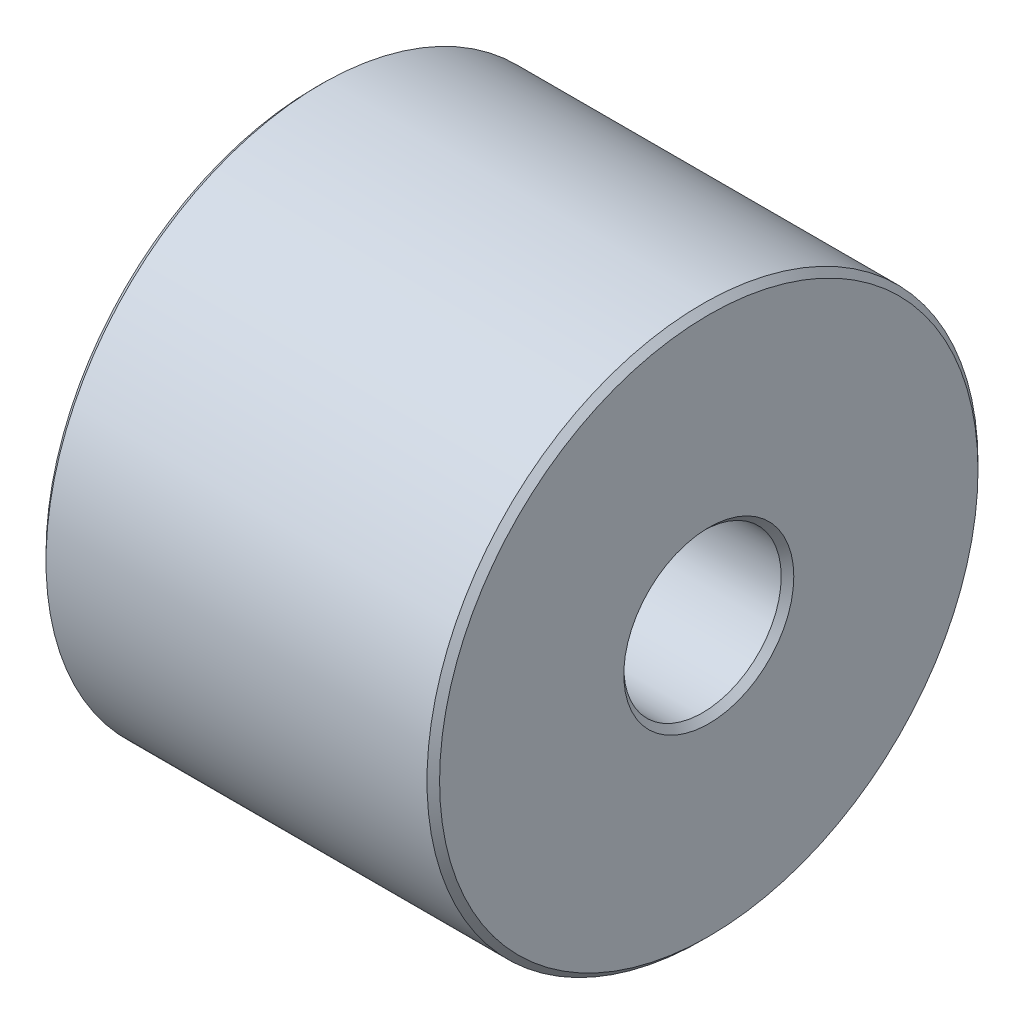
ISO-10303-21;
HEADER;
FILE_DESCRIPTION(('STEP AP214'),'2;1');
FILE_NAME('part.step','',(''),(''),'','','');
FILE_SCHEMA(('AUTOMOTIVE_DESIGN { 1 0 10303 214 1 1 1 1 }'));
ENDSEC;
DATA;
#1=APPLICATION_CONTEXT('core data for automotive mechanical design processes');
#2=APPLICATION_PROTOCOL_DEFINITION('international standard','automotive_design',2000,#1);
#3=PRODUCT_CONTEXT('',#1,'mechanical');
#4=PRODUCT('Part','Part','',(#3));
#5=PRODUCT_RELATED_PRODUCT_CATEGORY('part','',(#4));
#6=PRODUCT_DEFINITION_FORMATION('','',#4);
#7=PRODUCT_DEFINITION_CONTEXT('part definition',#1,'design');
#8=PRODUCT_DEFINITION('design','',#6,#7);
#9=PRODUCT_DEFINITION_SHAPE('','',#8);
#10=(LENGTH_UNIT() NAMED_UNIT(*) SI_UNIT(.MILLI.,.METRE.));
#11=(NAMED_UNIT(*) PLANE_ANGLE_UNIT() SI_UNIT($,.RADIAN.));
#12=(NAMED_UNIT(*) SI_UNIT($,.STERADIAN.) SOLID_ANGLE_UNIT());
#13=UNCERTAINTY_MEASURE_WITH_UNIT(LENGTH_MEASURE(1.E-05),#10,'distance_accuracy_value','');
#14=(GEOMETRIC_REPRESENTATION_CONTEXT(3) GLOBAL_UNCERTAINTY_ASSIGNED_CONTEXT((#13)) GLOBAL_UNIT_ASSIGNED_CONTEXT((#10,
#11,#12)) REPRESENTATION_CONTEXT('',''));
#15=CARTESIAN_POINT('',(0.,0.,0.));
#16=DIRECTION('',(0.,0.,1.));
#17=DIRECTION('',(1.,0.,0.));
#18=AXIS2_PLACEMENT_3D('',#15,#16,#17);
#19=CARTESIAN_POINT('',(15.875,0.,0.));
#20=DIRECTION('',(1.,0.,0.));
#21=DIRECTION('',(0.,0.,-1.));
#22=AXIS2_PLACEMENT_3D('',#19,#20,#21);
#23=PLANE('',#22);
#24=CARTESIAN_POINT('',(15.875,0.,0.));
#25=DIRECTION('',(1.,0.,0.));
#26=DIRECTION('',(0.,0.,-1.));
#27=AXIS2_PLACEMENT_3D('',#24,#25,#26);
#28=CIRCLE('',#27,3.42900000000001);
#29=CARTESIAN_POINT('',(15.875,0.,-3.42900000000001));
#30=VERTEX_POINT('',#29);
#31=EDGE_CURVE('E9',#30,#30,#28,.F.);
#32=ORIENTED_EDGE('',*,*,#31,.T.);
#33=EDGE_LOOP('',(#32));
#34=FACE_BOUND('',#33,.T.);
#35=CARTESIAN_POINT('',(15.875,0.,0.));
#36=DIRECTION('',(1.,0.,0.));
#37=DIRECTION('',(0.,0.,-1.));
#38=AXIS2_PLACEMENT_3D('',#35,#36,#37);
#39=CIRCLE('',#38,10.8585);
#40=CARTESIAN_POINT('',(15.875,0.,-10.8585));
#41=VERTEX_POINT('',#40);
#42=EDGE_CURVE('E21',#41,#41,#39,.T.);
#43=ORIENTED_EDGE('',*,*,#42,.T.);
#44=EDGE_LOOP('',(#43));
#45=FACE_BOUND('',#44,.T.);
#46=ADVANCED_FACE('F14',(#34,#45),#23,.T.);
#47=CARTESIAN_POINT('',(0.,0.,0.));
#48=DIRECTION('',(1.,0.,0.));
#49=DIRECTION('',(0.,0.,-1.));
#50=AXIS2_PLACEMENT_3D('',#47,#48,#49);
#51=PLANE('',#50);
#52=CARTESIAN_POINT('',(0.,0.,0.));
#53=DIRECTION('',(1.,0.,0.));
#54=DIRECTION('',(0.,0.,-1.));
#55=AXIS2_PLACEMENT_3D('',#52,#53,#54);
#56=CIRCLE('',#55,3.429);
#57=CARTESIAN_POINT('',(0.,0.,-3.429));
#58=VERTEX_POINT('',#57);
#59=EDGE_CURVE('E40',#58,#58,#56,.T.);
#60=ORIENTED_EDGE('',*,*,#59,.T.);
#61=EDGE_LOOP('',(#60));
#62=FACE_BOUND('',#61,.T.);
#63=CARTESIAN_POINT('',(0.,0.,0.));
#64=DIRECTION('',(1.,0.,0.));
#65=DIRECTION('',(0.,0.,-1.));
#66=AXIS2_PLACEMENT_3D('',#63,#64,#65);
#67=CIRCLE('',#66,10.8585);
#68=CARTESIAN_POINT('',(0.,0.,-10.8585));
#69=VERTEX_POINT('',#68);
#70=EDGE_CURVE('E43',#69,#69,#67,.F.);
#71=ORIENTED_EDGE('',*,*,#70,.T.);
#72=EDGE_LOOP('',(#71));
#73=FACE_BOUND('',#72,.T.);
#74=ADVANCED_FACE('F47',(#62,#73),#51,.F.);
#75=CARTESIAN_POINT('',(15.875,0.,0.));
#76=DIRECTION('',(-1.,0.,0.));
#77=DIRECTION('',(0.,0.,1.));
#78=AXIS2_PLACEMENT_3D('',#75,#76,#77);
#79=CYLINDRICAL_SURFACE('',#78,11.1125);
#80=CARTESIAN_POINT('',(0.254000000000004,0.,0.));
#81=DIRECTION('',(1.,0.,0.));
#82=DIRECTION('',(0.,0.,-1.));
#83=AXIS2_PLACEMENT_3D('',#80,#81,#82);
#84=CIRCLE('',#83,11.1125);
#85=CARTESIAN_POINT('',(0.254000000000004,0.,-11.1125));
#86=VERTEX_POINT('',#85);
#87=EDGE_CURVE('E25',#86,#86,#84,.T.);
#88=ORIENTED_EDGE('',*,*,#87,.T.);
#89=EDGE_LOOP('',(#88));
#90=FACE_BOUND('',#89,.T.);
#91=CARTESIAN_POINT('',(15.621,0.,0.));
#92=DIRECTION('',(1.,0.,0.));
#93=DIRECTION('',(0.,0.,-1.));
#94=AXIS2_PLACEMENT_3D('',#91,#92,#93);
#95=CIRCLE('',#94,11.1125);
#96=CARTESIAN_POINT('',(15.621,0.,-11.1125));
#97=VERTEX_POINT('',#96);
#98=EDGE_CURVE('E29',#97,#97,#95,.F.);
#99=ORIENTED_EDGE('',*,*,#98,.T.);
#100=EDGE_LOOP('',(#99));
#101=FACE_BOUND('',#100,.T.);
#102=ADVANCED_FACE('F57',(#90,#101),#79,.T.);
#103=CARTESIAN_POINT('',(15.875,0.,0.));
#104=DIRECTION('',(-1.,0.,0.));
#105=DIRECTION('',(0.,0.,1.));
#106=AXIS2_PLACEMENT_3D('',#103,#104,#105);
#107=CYLINDRICAL_SURFACE('',#106,3.175);
#108=CARTESIAN_POINT('',(0.254000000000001,0.,0.));
#109=DIRECTION('',(1.,0.,0.));
#110=DIRECTION('',(0.,0.,-1.));
#111=AXIS2_PLACEMENT_3D('',#108,#109,#110);
#112=CIRCLE('',#111,3.175);
#113=CARTESIAN_POINT('',(0.254000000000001,0.,-3.175));
#114=VERTEX_POINT('',#113);
#115=EDGE_CURVE('E34',#114,#114,#112,.F.);
#116=ORIENTED_EDGE('',*,*,#115,.T.);
#117=EDGE_LOOP('',(#116));
#118=FACE_BOUND('',#117,.T.);
#119=CARTESIAN_POINT('',(15.621,0.,0.));
#120=DIRECTION('',(1.,0.,0.));
#121=DIRECTION('',(0.,0.,-1.));
#122=AXIS2_PLACEMENT_3D('',#119,#120,#121);
#123=CIRCLE('',#122,3.175);
#124=CARTESIAN_POINT('',(15.621,0.,-3.175));
#125=VERTEX_POINT('',#124);
#126=EDGE_CURVE('E37',#125,#125,#123,.T.);
#127=ORIENTED_EDGE('',*,*,#126,.T.);
#128=EDGE_LOOP('',(#127));
#129=FACE_BOUND('',#128,.T.);
#130=ADVANCED_FACE('F60',(#118,#129),#107,.F.);
#131=CARTESIAN_POINT('',(0.,0.,0.));
#132=DIRECTION('',(-1.,0.,0.));
#133=DIRECTION('',(0.,0.,1.));
#134=AXIS2_PLACEMENT_3D('',#131,#132,#133);
#135=CONICAL_SURFACE('',#134,3.429,0.785398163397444);
#136=ORIENTED_EDGE('',*,*,#115,.F.);
#137=EDGE_LOOP('',(#136));
#138=FACE_BOUND('',#137,.T.);
#139=ORIENTED_EDGE('',*,*,#59,.F.);
#140=EDGE_LOOP('',(#139));
#141=FACE_BOUND('',#140,.T.);
#142=ADVANCED_FACE('F53',(#138,#141),#135,.F.);
#143=CARTESIAN_POINT('',(0.254000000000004,0.,0.));
#144=DIRECTION('',(1.,0.,0.));
#145=DIRECTION('',(0.,0.,-1.));
#146=AXIS2_PLACEMENT_3D('',#143,#144,#145);
#147=CONICAL_SURFACE('',#146,11.1125,0.785398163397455);
#148=ORIENTED_EDGE('',*,*,#70,.F.);
#149=EDGE_LOOP('',(#148));
#150=FACE_BOUND('',#149,.T.);
#151=ORIENTED_EDGE('',*,*,#87,.F.);
#152=EDGE_LOOP('',(#151));
#153=FACE_BOUND('',#152,.T.);
#154=ADVANCED_FACE('F49',(#150,#153),#147,.T.);
#155=CARTESIAN_POINT('',(15.621,0.,0.));
#156=DIRECTION('',(1.,0.,0.));
#157=DIRECTION('',(0.,0.,-1.));
#158=AXIS2_PLACEMENT_3D('',#155,#156,#157);
#159=CONICAL_SURFACE('',#158,3.175,0.785398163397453);
#160=ORIENTED_EDGE('',*,*,#31,.F.);
#161=EDGE_LOOP('',(#160));
#162=FACE_BOUND('',#161,.T.);
#163=ORIENTED_EDGE('',*,*,#126,.F.);
#164=EDGE_LOOP('',(#163));
#165=FACE_BOUND('',#164,.T.);
#166=ADVANCED_FACE('F52',(#162,#165),#159,.F.);
#167=CARTESIAN_POINT('',(15.875,0.,0.));
#168=DIRECTION('',(-1.,0.,0.));
#169=DIRECTION('',(0.,0.,1.));
#170=AXIS2_PLACEMENT_3D('',#167,#168,#169);
#171=CONICAL_SURFACE('',#170,10.8585,0.785398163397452);
#172=ORIENTED_EDGE('',*,*,#98,.F.);
#173=EDGE_LOOP('',(#172));
#174=FACE_BOUND('',#173,.T.);
#175=ORIENTED_EDGE('',*,*,#42,.F.);
#176=EDGE_LOOP('',(#175));
#177=FACE_BOUND('',#176,.T.);
#178=ADVANCED_FACE('F16',(#174,#177),#171,.T.);
#179=CLOSED_SHELL('',(#46,#74,#102,#130,#142,#154,#166,#178));
#180=MANIFOLD_SOLID_BREP('B1',#179);
#181=ADVANCED_BREP_SHAPE_REPRESENTATION('',(#18,#180),#14);
#182=SHAPE_DEFINITION_REPRESENTATION(#9,#181);
ENDSEC;
END-ISO-10303-21;
